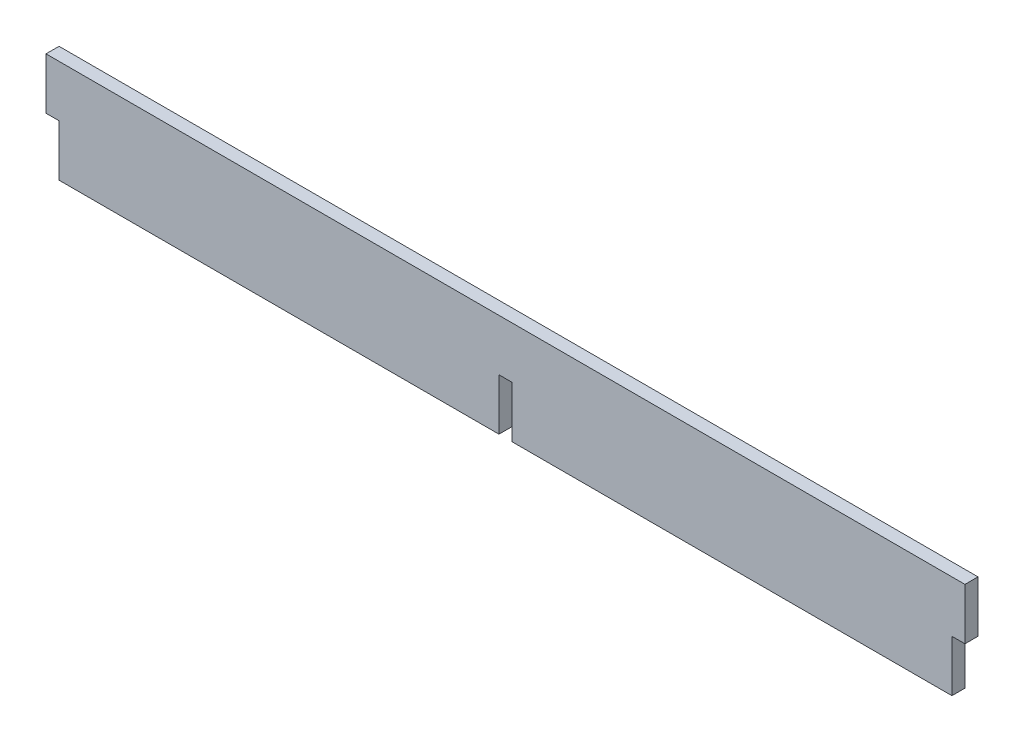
ISO-10303-21;
HEADER;
FILE_DESCRIPTION(('STEP AP214'),'2;1');
FILE_NAME('part.step','',(''),(''),'','','');
FILE_SCHEMA(('AUTOMOTIVE_DESIGN { 1 0 10303 214 1 1 1 1 }'));
ENDSEC;
DATA;
#1=APPLICATION_CONTEXT('core data for automotive mechanical design processes');
#2=APPLICATION_PROTOCOL_DEFINITION('international standard','automotive_design',2000,#1);
#3=PRODUCT_CONTEXT('',#1,'mechanical');
#4=PRODUCT('Part','Part','',(#3));
#5=PRODUCT_RELATED_PRODUCT_CATEGORY('part','',(#4));
#6=PRODUCT_DEFINITION_FORMATION('','',#4);
#7=PRODUCT_DEFINITION_CONTEXT('part definition',#1,'design');
#8=PRODUCT_DEFINITION('design','',#6,#7);
#9=PRODUCT_DEFINITION_SHAPE('','',#8);
#10=(LENGTH_UNIT() NAMED_UNIT(*) SI_UNIT(.MILLI.,.METRE.));
#11=(NAMED_UNIT(*) PLANE_ANGLE_UNIT() SI_UNIT($,.RADIAN.));
#12=(NAMED_UNIT(*) SI_UNIT($,.STERADIAN.) SOLID_ANGLE_UNIT());
#13=UNCERTAINTY_MEASURE_WITH_UNIT(LENGTH_MEASURE(1.E-05),#10,'distance_accuracy_value','');
#14=(GEOMETRIC_REPRESENTATION_CONTEXT(3) GLOBAL_UNCERTAINTY_ASSIGNED_CONTEXT((#13)) GLOBAL_UNIT_ASSIGNED_CONTEXT((#10,
#11,#12)) REPRESENTATION_CONTEXT('',''));
#15=CARTESIAN_POINT('',(0.,0.,0.));
#16=DIRECTION('',(0.,0.,1.));
#17=DIRECTION('',(1.,0.,0.));
#18=AXIS2_PLACEMENT_3D('',#15,#16,#17);
#19=CARTESIAN_POINT('',(0.,14.49,-3.2));
#20=DIRECTION('',(-1.,0.,0.));
#21=DIRECTION('',(0.,0.,-1.));
#22=AXIS2_PLACEMENT_3D('',#19,#20,#21);
#23=PLANE('',#22);
#24=DIRECTION('',(0.,1.,0.));
#25=VECTOR('',#24,1.);
#26=CARTESIAN_POINT('',(0.,14.49,0.));
#27=LINE('',#26,#25);
#28=CARTESIAN_POINT('',(0.,14.49,0.));
#29=VERTEX_POINT('',#28);
#30=CARTESIAN_POINT('',(0.,27.115,0.));
#31=VERTEX_POINT('',#30);
#32=EDGE_CURVE('E173',#29,#31,#27,.T.);
#33=ORIENTED_EDGE('',*,*,#32,.T.);
#34=DIRECTION('',(0.,0.,1.));
#35=VECTOR('',#34,1.);
#36=CARTESIAN_POINT('',(0.,27.115,-3.2));
#37=LINE('',#36,#35);
#38=CARTESIAN_POINT('',(0.,27.115,-3.2));
#39=VERTEX_POINT('',#38);
#40=EDGE_CURVE('E50',#39,#31,#37,.T.);
#41=ORIENTED_EDGE('',*,*,#40,.F.);
#42=DIRECTION('',(0.,1.,0.));
#43=VECTOR('',#42,1.);
#44=CARTESIAN_POINT('',(0.,14.49,-3.2));
#45=LINE('',#44,#43);
#46=CARTESIAN_POINT('',(0.,14.49,-3.2));
#47=VERTEX_POINT('',#46);
#48=EDGE_CURVE('E211',#47,#39,#45,.T.);
#49=ORIENTED_EDGE('',*,*,#48,.F.);
#50=DIRECTION('',(0.,0.,1.));
#51=VECTOR('',#50,1.);
#52=CARTESIAN_POINT('',(0.,14.49,-3.2));
#53=LINE('',#52,#51);
#54=EDGE_CURVE('E11',#47,#29,#53,.T.);
#55=ORIENTED_EDGE('',*,*,#54,.T.);
#56=EDGE_LOOP('',(#33,#41,#49,#55));
#57=FACE_BOUND('',#56,.T.);
#58=ADVANCED_FACE('F47',(#57),#23,.T.);
#59=CARTESIAN_POINT('',(0.,14.49,-3.2));
#60=DIRECTION('',(0.,1.,0.));
#61=DIRECTION('',(0.,0.,-1.));
#62=AXIS2_PLACEMENT_3D('',#59,#60,#61);
#63=PLANE('',#62);
#64=DIRECTION('',(1.,0.,0.));
#65=VECTOR('',#64,1.);
#66=CARTESIAN_POINT('',(0.,14.49,0.));
#67=LINE('',#66,#65);
#68=CARTESIAN_POINT('',(3.2,14.49,0.));
#69=VERTEX_POINT('',#68);
#70=EDGE_CURVE('E113',#29,#69,#67,.T.);
#71=ORIENTED_EDGE('',*,*,#70,.F.);
#72=ORIENTED_EDGE('',*,*,#54,.F.);
#73=DIRECTION('',(1.,0.,0.));
#74=VECTOR('',#73,1.);
#75=CARTESIAN_POINT('',(0.,14.49,-3.2));
#76=LINE('',#75,#74);
#77=CARTESIAN_POINT('',(3.2,14.49,-3.2));
#78=VERTEX_POINT('',#77);
#79=EDGE_CURVE('E66',#47,#78,#76,.T.);
#80=ORIENTED_EDGE('',*,*,#79,.T.);
#81=DIRECTION('',(0.,0.,1.));
#82=VECTOR('',#81,1.);
#83=CARTESIAN_POINT('',(3.2,14.49,-3.2));
#84=LINE('',#83,#82);
#85=EDGE_CURVE('E57',#78,#69,#84,.T.);
#86=ORIENTED_EDGE('',*,*,#85,.T.);
#87=EDGE_LOOP('',(#71,#72,#80,#86));
#88=FACE_BOUND('',#87,.T.);
#89=ADVANCED_FACE('F312',(#88),#63,.F.);
#90=CARTESIAN_POINT('',(3.2,1.865,-3.2));
#91=DIRECTION('',(-1.,0.,0.));
#92=DIRECTION('',(0.,0.,-1.));
#93=AXIS2_PLACEMENT_3D('',#90,#91,#92);
#94=PLANE('',#93);
#95=DIRECTION('',(0.,1.,0.));
#96=VECTOR('',#95,1.);
#97=CARTESIAN_POINT('',(3.2,1.865,0.));
#98=LINE('',#97,#96);
#99=CARTESIAN_POINT('',(3.2,1.865,0.));
#100=VERTEX_POINT('',#99);
#101=EDGE_CURVE('E107',#100,#69,#98,.T.);
#102=ORIENTED_EDGE('',*,*,#101,.T.);
#103=ORIENTED_EDGE('',*,*,#85,.F.);
#104=DIRECTION('',(0.,1.,0.));
#105=VECTOR('',#104,1.);
#106=CARTESIAN_POINT('',(3.2,1.865,-3.2));
#107=LINE('',#106,#105);
#108=CARTESIAN_POINT('',(3.2,1.865,-3.2));
#109=VERTEX_POINT('',#108);
#110=EDGE_CURVE('E150',#109,#78,#107,.T.);
#111=ORIENTED_EDGE('',*,*,#110,.F.);
#112=DIRECTION('',(0.,0.,1.));
#113=VECTOR('',#112,1.);
#114=CARTESIAN_POINT('',(3.2,1.865,-3.2));
#115=LINE('',#114,#113);
#116=EDGE_CURVE('E158',#109,#100,#115,.T.);
#117=ORIENTED_EDGE('',*,*,#116,.T.);
#118=EDGE_LOOP('',(#102,#103,#111,#117));
#119=FACE_BOUND('',#118,.T.);
#120=ADVANCED_FACE('F165',(#119),#94,.T.);
#121=CARTESIAN_POINT('',(3.2,1.865,-3.2));
#122=DIRECTION('',(0.,1.,0.));
#123=DIRECTION('',(0.,0.,-1.));
#124=AXIS2_PLACEMENT_3D('',#121,#122,#123);
#125=PLANE('',#124);
#126=DIRECTION('',(1.,0.,0.));
#127=VECTOR('',#126,1.);
#128=CARTESIAN_POINT('',(3.2,1.865,0.));
#129=LINE('',#128,#127);
#130=CARTESIAN_POINT('',(111.115,1.865,0.));
#131=VERTEX_POINT('',#130);
#132=EDGE_CURVE('E161',#100,#131,#129,.T.);
#133=ORIENTED_EDGE('',*,*,#132,.F.);
#134=ORIENTED_EDGE('',*,*,#116,.F.);
#135=DIRECTION('',(1.,0.,0.));
#136=VECTOR('',#135,1.);
#137=CARTESIAN_POINT('',(3.2,1.865,-3.2));
#138=LINE('',#137,#136);
#139=CARTESIAN_POINT('',(111.115,1.865,-3.2));
#140=VERTEX_POINT('',#139);
#141=EDGE_CURVE('E146',#109,#140,#138,.T.);
#142=ORIENTED_EDGE('',*,*,#141,.T.);
#143=DIRECTION('',(0.,0.,1.));
#144=VECTOR('',#143,1.);
#145=CARTESIAN_POINT('',(111.115,1.865,-3.2));
#146=LINE('',#145,#144);
#147=EDGE_CURVE('E163',#140,#131,#146,.T.);
#148=ORIENTED_EDGE('',*,*,#147,.T.);
#149=EDGE_LOOP('',(#133,#134,#142,#148));
#150=FACE_BOUND('',#149,.T.);
#151=ADVANCED_FACE('F159',(#150),#125,.F.);
#152=CARTESIAN_POINT('',(111.115,1.865,-3.2));
#153=DIRECTION('',(-1.,0.,0.));
#154=DIRECTION('',(0.,0.,-1.));
#155=AXIS2_PLACEMENT_3D('',#152,#153,#154);
#156=PLANE('',#155);
#157=DIRECTION('',(0.,1.,0.));
#158=VECTOR('',#157,1.);
#159=CARTESIAN_POINT('',(111.115,1.865,0.));
#160=LINE('',#159,#158);
#161=CARTESIAN_POINT('',(111.115,14.49,0.));
#162=VERTEX_POINT('',#161);
#163=EDGE_CURVE('E202',#131,#162,#160,.T.);
#164=ORIENTED_EDGE('',*,*,#163,.F.);
#165=ORIENTED_EDGE('',*,*,#147,.F.);
#166=DIRECTION('',(0.,1.,0.));
#167=VECTOR('',#166,1.);
#168=CARTESIAN_POINT('',(111.115,1.865,-3.2));
#169=LINE('',#168,#167);
#170=CARTESIAN_POINT('',(111.115,14.49,-3.2));
#171=VERTEX_POINT('',#170);
#172=EDGE_CURVE('E152',#140,#171,#169,.T.);
#173=ORIENTED_EDGE('',*,*,#172,.T.);
#174=DIRECTION('',(0.,0.,1.));
#175=VECTOR('',#174,1.);
#176=CARTESIAN_POINT('',(111.115,14.49,-3.2));
#177=LINE('',#176,#175);
#178=EDGE_CURVE('E217',#171,#162,#177,.T.);
#179=ORIENTED_EDGE('',*,*,#178,.T.);
#180=EDGE_LOOP('',(#164,#165,#173,#179));
#181=FACE_BOUND('',#180,.T.);
#182=ADVANCED_FACE('F288',(#181),#156,.F.);
#183=CARTESIAN_POINT('',(111.115,14.49,-3.2));
#184=DIRECTION('',(0.,1.,0.));
#185=DIRECTION('',(0.,0.,-1.));
#186=AXIS2_PLACEMENT_3D('',#183,#184,#185);
#187=PLANE('',#186);
#188=DIRECTION('',(1.,0.,0.));
#189=VECTOR('',#188,1.);
#190=CARTESIAN_POINT('',(111.115,14.49,0.));
#191=LINE('',#190,#189);
#192=CARTESIAN_POINT('',(114.315,14.49,0.));
#193=VERTEX_POINT('',#192);
#194=EDGE_CURVE('E198',#162,#193,#191,.T.);
#195=ORIENTED_EDGE('',*,*,#194,.F.);
#196=ORIENTED_EDGE('',*,*,#178,.F.);
#197=DIRECTION('',(1.,0.,0.));
#198=VECTOR('',#197,1.);
#199=CARTESIAN_POINT('',(111.115,14.49,-3.2));
#200=LINE('',#199,#198);
#201=CARTESIAN_POINT('',(114.315,14.49,-3.2));
#202=VERTEX_POINT('',#201);
#203=EDGE_CURVE('E282',#171,#202,#200,.T.);
#204=ORIENTED_EDGE('',*,*,#203,.T.);
#205=DIRECTION('',(0.,0.,1.));
#206=VECTOR('',#205,1.);
#207=CARTESIAN_POINT('',(114.315,14.49,-3.2));
#208=LINE('',#207,#206);
#209=EDGE_CURVE('E221',#202,#193,#208,.T.);
#210=ORIENTED_EDGE('',*,*,#209,.T.);
#211=EDGE_LOOP('',(#195,#196,#204,#210));
#212=FACE_BOUND('',#211,.T.);
#213=ADVANCED_FACE('F292',(#212),#187,.F.);
#214=CARTESIAN_POINT('',(114.315,1.865,-3.2));
#215=DIRECTION('',(-1.,0.,0.));
#216=DIRECTION('',(0.,0.,-1.));
#217=AXIS2_PLACEMENT_3D('',#214,#215,#216);
#218=PLANE('',#217);
#219=DIRECTION('',(0.,1.,0.));
#220=VECTOR('',#219,1.);
#221=CARTESIAN_POINT('',(114.315,1.865,0.));
#222=LINE('',#221,#220);
#223=CARTESIAN_POINT('',(114.315,1.865,0.));
#224=VERTEX_POINT('',#223);
#225=EDGE_CURVE('E195',#224,#193,#222,.T.);
#226=ORIENTED_EDGE('',*,*,#225,.T.);
#227=ORIENTED_EDGE('',*,*,#209,.F.);
#228=DIRECTION('',(0.,1.,0.));
#229=VECTOR('',#228,1.);
#230=CARTESIAN_POINT('',(114.315,1.865,-3.2));
#231=LINE('',#230,#229);
#232=CARTESIAN_POINT('',(114.315,1.865,-3.2));
#233=VERTEX_POINT('',#232);
#234=EDGE_CURVE('E279',#233,#202,#231,.T.);
#235=ORIENTED_EDGE('',*,*,#234,.F.);
#236=DIRECTION('',(0.,0.,1.));
#237=VECTOR('',#236,1.);
#238=CARTESIAN_POINT('',(114.315,1.865,-3.2));
#239=LINE('',#238,#237);
#240=EDGE_CURVE('E225',#233,#224,#239,.T.);
#241=ORIENTED_EDGE('',*,*,#240,.T.);
#242=EDGE_LOOP('',(#226,#227,#235,#241));
#243=FACE_BOUND('',#242,.T.);
#244=ADVANCED_FACE('F296',(#243),#218,.T.);
#245=CARTESIAN_POINT('',(114.315,1.865,-3.2));
#246=DIRECTION('',(0.,1.,0.));
#247=DIRECTION('',(0.,0.,-1.));
#248=AXIS2_PLACEMENT_3D('',#245,#246,#247);
#249=PLANE('',#248);
#250=DIRECTION('',(1.,0.,0.));
#251=VECTOR('',#250,1.);
#252=CARTESIAN_POINT('',(114.315,1.865,0.));
#253=LINE('',#252,#251);
#254=CARTESIAN_POINT('',(222.225,1.865,0.));
#255=VERTEX_POINT('',#254);
#256=EDGE_CURVE('E191',#224,#255,#253,.T.);
#257=ORIENTED_EDGE('',*,*,#256,.F.);
#258=ORIENTED_EDGE('',*,*,#240,.F.);
#259=DIRECTION('',(1.,0.,0.));
#260=VECTOR('',#259,1.);
#261=CARTESIAN_POINT('',(114.315,1.865,-3.2));
#262=LINE('',#261,#260);
#263=CARTESIAN_POINT('',(222.225,1.865,-3.2));
#264=VERTEX_POINT('',#263);
#265=EDGE_CURVE('E271',#233,#264,#262,.T.);
#266=ORIENTED_EDGE('',*,*,#265,.T.);
#267=DIRECTION('',(0.,0.,1.));
#268=VECTOR('',#267,1.);
#269=CARTESIAN_POINT('',(222.225,1.865,-3.2));
#270=LINE('',#269,#268);
#271=EDGE_CURVE('E229',#264,#255,#270,.T.);
#272=ORIENTED_EDGE('',*,*,#271,.T.);
#273=EDGE_LOOP('',(#257,#258,#266,#272));
#274=FACE_BOUND('',#273,.T.);
#275=ADVANCED_FACE('F299',(#274),#249,.F.);
#276=CARTESIAN_POINT('',(222.225,1.865,-3.2));
#277=DIRECTION('',(-1.,0.,0.));
#278=DIRECTION('',(0.,0.,-1.));
#279=AXIS2_PLACEMENT_3D('',#276,#277,#278);
#280=PLANE('',#279);
#281=DIRECTION('',(0.,1.,0.));
#282=VECTOR('',#281,1.);
#283=CARTESIAN_POINT('',(222.225,1.865,0.));
#284=LINE('',#283,#282);
#285=CARTESIAN_POINT('',(222.225,14.49,0.));
#286=VERTEX_POINT('',#285);
#287=EDGE_CURVE('E187',#255,#286,#284,.T.);
#288=ORIENTED_EDGE('',*,*,#287,.F.);
#289=ORIENTED_EDGE('',*,*,#271,.F.);
#290=DIRECTION('',(0.,1.,0.));
#291=VECTOR('',#290,1.);
#292=CARTESIAN_POINT('',(222.225,1.865,-3.2));
#293=LINE('',#292,#291);
#294=CARTESIAN_POINT('',(222.225,14.49,-3.2));
#295=VERTEX_POINT('',#294);
#296=EDGE_CURVE('E265',#264,#295,#293,.T.);
#297=ORIENTED_EDGE('',*,*,#296,.T.);
#298=DIRECTION('',(0.,0.,1.));
#299=VECTOR('',#298,1.);
#300=CARTESIAN_POINT('',(222.225,14.49,-3.2));
#301=LINE('',#300,#299);
#302=EDGE_CURVE('E233',#295,#286,#301,.T.);
#303=ORIENTED_EDGE('',*,*,#302,.T.);
#304=EDGE_LOOP('',(#288,#289,#297,#303));
#305=FACE_BOUND('',#304,.T.);
#306=ADVANCED_FACE('F302',(#305),#280,.F.);
#307=CARTESIAN_POINT('',(225.425,14.49,-3.2));
#308=DIRECTION('',(0.,-1.,0.));
#309=DIRECTION('',(0.,0.,1.));
#310=AXIS2_PLACEMENT_3D('',#307,#308,#309);
#311=PLANE('',#310);
#312=DIRECTION('',(-1.,0.,0.));
#313=VECTOR('',#312,1.);
#314=CARTESIAN_POINT('',(225.425,14.49,0.));
#315=LINE('',#314,#313);
#316=CARTESIAN_POINT('',(225.425,14.49,0.));
#317=VERTEX_POINT('',#316);
#318=EDGE_CURVE('E184',#317,#286,#315,.T.);
#319=ORIENTED_EDGE('',*,*,#318,.T.);
#320=ORIENTED_EDGE('',*,*,#302,.F.);
#321=DIRECTION('',(-1.,0.,0.));
#322=VECTOR('',#321,1.);
#323=CARTESIAN_POINT('',(225.425,14.49,-3.2));
#324=LINE('',#323,#322);
#325=CARTESIAN_POINT('',(225.425,14.49,-3.2));
#326=VERTEX_POINT('',#325);
#327=EDGE_CURVE('E262',#326,#295,#324,.T.);
#328=ORIENTED_EDGE('',*,*,#327,.F.);
#329=DIRECTION('',(0.,0.,1.));
#330=VECTOR('',#329,1.);
#331=CARTESIAN_POINT('',(225.425,14.49,-3.2));
#332=LINE('',#331,#330);
#333=EDGE_CURVE('E237',#326,#317,#332,.T.);
#334=ORIENTED_EDGE('',*,*,#333,.T.);
#335=EDGE_LOOP('',(#319,#320,#328,#334));
#336=FACE_BOUND('',#335,.T.);
#337=ADVANCED_FACE('F260',(#336),#311,.T.);
#338=CARTESIAN_POINT('',(225.425,14.49,-3.2));
#339=DIRECTION('',(-1.,0.,0.));
#340=DIRECTION('',(0.,0.,-1.));
#341=AXIS2_PLACEMENT_3D('',#338,#339,#340);
#342=PLANE('',#341);
#343=DIRECTION('',(0.,1.,0.));
#344=VECTOR('',#343,1.);
#345=CARTESIAN_POINT('',(225.425,14.49,0.));
#346=LINE('',#345,#344);
#347=CARTESIAN_POINT('',(225.425,27.115,0.));
#348=VERTEX_POINT('',#347);
#349=EDGE_CURVE('E180',#317,#348,#346,.T.);
#350=ORIENTED_EDGE('',*,*,#349,.F.);
#351=ORIENTED_EDGE('',*,*,#333,.F.);
#352=DIRECTION('',(0.,1.,0.));
#353=VECTOR('',#352,1.);
#354=CARTESIAN_POINT('',(225.425,14.49,-3.2));
#355=LINE('',#354,#353);
#356=CARTESIAN_POINT('',(225.425,27.115,-3.2));
#357=VERTEX_POINT('',#356);
#358=EDGE_CURVE('E266',#326,#357,#355,.T.);
#359=ORIENTED_EDGE('',*,*,#358,.T.);
#360=DIRECTION('',(0.,0.,1.));
#361=VECTOR('',#360,1.);
#362=CARTESIAN_POINT('',(225.425,27.115,-3.2));
#363=LINE('',#362,#361);
#364=EDGE_CURVE('E240',#357,#348,#363,.T.);
#365=ORIENTED_EDGE('',*,*,#364,.T.);
#366=EDGE_LOOP('',(#350,#351,#359,#365));
#367=FACE_BOUND('',#366,.T.);
#368=ADVANCED_FACE('F257',(#367),#342,.F.);
#369=CARTESIAN_POINT('',(0.,27.115,-3.2));
#370=DIRECTION('',(0.,1.,0.));
#371=DIRECTION('',(0.,0.,-1.));
#372=AXIS2_PLACEMENT_3D('',#369,#370,#371);
#373=PLANE('',#372);
#374=DIRECTION('',(1.,0.,0.));
#375=VECTOR('',#374,1.);
#376=CARTESIAN_POINT('',(0.,27.115,0.));
#377=LINE('',#376,#375);
#378=EDGE_CURVE('E177',#31,#348,#377,.T.);
#379=ORIENTED_EDGE('',*,*,#378,.T.);
#380=ORIENTED_EDGE('',*,*,#364,.F.);
#381=DIRECTION('',(1.,0.,0.));
#382=VECTOR('',#381,1.);
#383=CARTESIAN_POINT('',(0.,27.115,-3.2));
#384=LINE('',#383,#382);
#385=EDGE_CURVE('E121',#39,#357,#384,.T.);
#386=ORIENTED_EDGE('',*,*,#385,.F.);
#387=ORIENTED_EDGE('',*,*,#40,.T.);
#388=EDGE_LOOP('',(#379,#380,#386,#387));
#389=FACE_BOUND('',#388,.T.);
#390=ADVANCED_FACE('F249',(#389),#373,.T.);
#391=CARTESIAN_POINT('',(0.,0.,-3.2));
#392=DIRECTION('',(0.,0.,1.));
#393=DIRECTION('',(-1.,0.,0.));
#394=AXIS2_PLACEMENT_3D('',#391,#392,#393);
#395=PLANE('',#394);
#396=ORIENTED_EDGE('',*,*,#48,.T.);
#397=ORIENTED_EDGE('',*,*,#385,.T.);
#398=ORIENTED_EDGE('',*,*,#358,.F.);
#399=ORIENTED_EDGE('',*,*,#327,.T.);
#400=ORIENTED_EDGE('',*,*,#296,.F.);
#401=ORIENTED_EDGE('',*,*,#265,.F.);
#402=ORIENTED_EDGE('',*,*,#234,.T.);
#403=ORIENTED_EDGE('',*,*,#203,.F.);
#404=ORIENTED_EDGE('',*,*,#172,.F.);
#405=ORIENTED_EDGE('',*,*,#141,.F.);
#406=ORIENTED_EDGE('',*,*,#110,.T.);
#407=ORIENTED_EDGE('',*,*,#79,.F.);
#408=EDGE_LOOP('',(#396,#397,#398,#399,#400,#401,#402,#403,#404,#405,#406,#407));
#409=FACE_BOUND('',#408,.T.);
#410=ADVANCED_FACE('F148',(#409),#395,.F.);
#411=CARTESIAN_POINT('',(0.,0.,0.));
#412=DIRECTION('',(0.,0.,1.));
#413=DIRECTION('',(-1.,0.,0.));
#414=AXIS2_PLACEMENT_3D('',#411,#412,#413);
#415=PLANE('',#414);
#416=ORIENTED_EDGE('',*,*,#32,.F.);
#417=ORIENTED_EDGE('',*,*,#70,.T.);
#418=ORIENTED_EDGE('',*,*,#101,.F.);
#419=ORIENTED_EDGE('',*,*,#132,.T.);
#420=ORIENTED_EDGE('',*,*,#163,.T.);
#421=ORIENTED_EDGE('',*,*,#194,.T.);
#422=ORIENTED_EDGE('',*,*,#225,.F.);
#423=ORIENTED_EDGE('',*,*,#256,.T.);
#424=ORIENTED_EDGE('',*,*,#287,.T.);
#425=ORIENTED_EDGE('',*,*,#318,.F.);
#426=ORIENTED_EDGE('',*,*,#349,.T.);
#427=ORIENTED_EDGE('',*,*,#378,.F.);
#428=EDGE_LOOP('',(#416,#417,#418,#419,#420,#421,#422,#423,#424,#425,#426,#427));
#429=FACE_BOUND('',#428,.T.);
#430=ADVANCED_FACE('F254',(#429),#415,.T.);
#431=CLOSED_SHELL('',(#58,#89,#120,#151,#182,#213,#244,#275,#306,#337,#368,#390,#410,#430));
#432=MANIFOLD_SOLID_BREP('B2',#431);
#433=ADVANCED_BREP_SHAPE_REPRESENTATION('',(#18,#432),#14);
#434=SHAPE_DEFINITION_REPRESENTATION(#9,#433);
ENDSEC;
END-ISO-10303-21;
